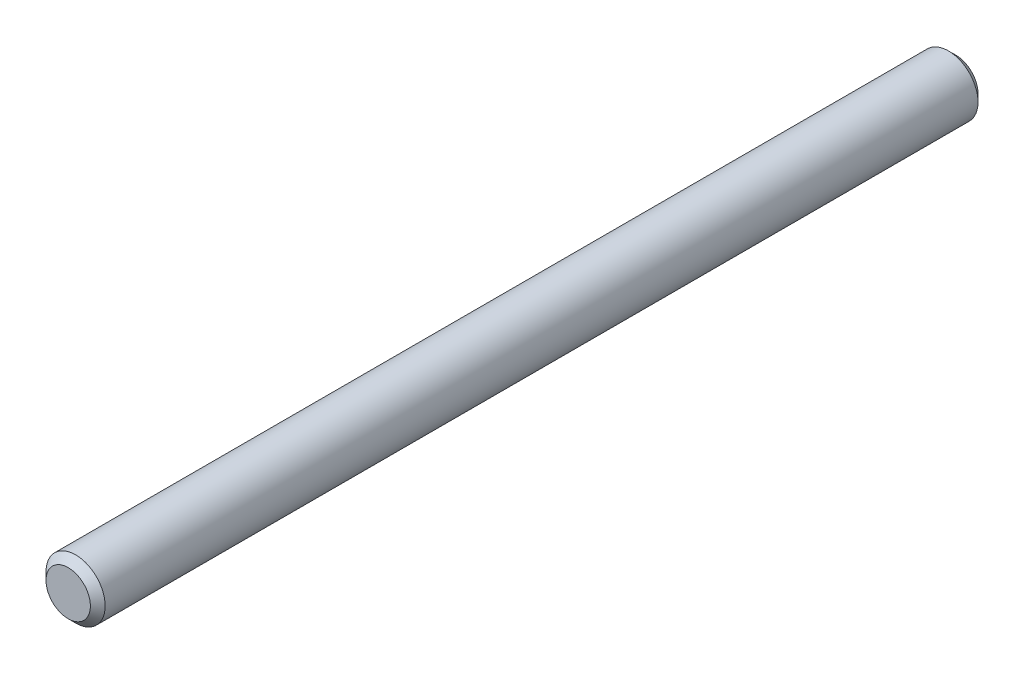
ISO-10303-21;
HEADER;
FILE_DESCRIPTION(('STEP AP214'),'2;1');
FILE_NAME('part.step','',(''),(''),'','','');
FILE_SCHEMA(('AUTOMOTIVE_DESIGN { 1 0 10303 214 1 1 1 1 }'));
ENDSEC;
DATA;
#1=APPLICATION_CONTEXT('core data for automotive mechanical design processes');
#2=APPLICATION_PROTOCOL_DEFINITION('international standard','automotive_design',2000,#1);
#3=PRODUCT_CONTEXT('',#1,'mechanical');
#4=PRODUCT('Part','Part','',(#3));
#5=PRODUCT_RELATED_PRODUCT_CATEGORY('part','',(#4));
#6=PRODUCT_DEFINITION_FORMATION('','',#4);
#7=PRODUCT_DEFINITION_CONTEXT('part definition',#1,'design');
#8=PRODUCT_DEFINITION('design','',#6,#7);
#9=PRODUCT_DEFINITION_SHAPE('','',#8);
#10=(LENGTH_UNIT() NAMED_UNIT(*) SI_UNIT(.MILLI.,.METRE.));
#11=(NAMED_UNIT(*) PLANE_ANGLE_UNIT() SI_UNIT($,.RADIAN.));
#12=(NAMED_UNIT(*) SI_UNIT($,.STERADIAN.) SOLID_ANGLE_UNIT());
#13=UNCERTAINTY_MEASURE_WITH_UNIT(LENGTH_MEASURE(1.E-05),#10,'distance_accuracy_value','');
#14=(GEOMETRIC_REPRESENTATION_CONTEXT(3) GLOBAL_UNCERTAINTY_ASSIGNED_CONTEXT((#13)) GLOBAL_UNIT_ASSIGNED_CONTEXT((#10,
#11,#12)) REPRESENTATION_CONTEXT('',''));
#15=CARTESIAN_POINT('',(0.,0.,0.));
#16=DIRECTION('',(0.,0.,1.));
#17=DIRECTION('',(1.,0.,0.));
#18=AXIS2_PLACEMENT_3D('',#15,#16,#17);
#19=CARTESIAN_POINT('',(0.,0.,-60.));
#20=DIRECTION('',(0.,0.,1.));
#21=DIRECTION('',(1.,0.,0.));
#22=AXIS2_PLACEMENT_3D('',#19,#20,#21);
#23=CYLINDRICAL_SURFACE('',#22,2.);
#24=CARTESIAN_POINT('',(0.,0.,-59.5));
#25=DIRECTION('',(0.,0.,1.));
#26=DIRECTION('',(1.,0.,0.));
#27=AXIS2_PLACEMENT_3D('',#24,#25,#26);
#28=CIRCLE('',#27,2.);
#29=CARTESIAN_POINT('',(2.,0.,-59.5));
#30=VERTEX_POINT('',#29);
#31=EDGE_CURVE('E43',#30,#30,#28,.T.);
#32=ORIENTED_EDGE('',*,*,#31,.T.);
#33=EDGE_LOOP('',(#32));
#34=FACE_BOUND('',#33,.T.);
#35=CARTESIAN_POINT('',(0.,0.,-0.499999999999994));
#36=DIRECTION('',(0.,0.,1.));
#37=DIRECTION('',(1.,0.,0.));
#38=AXIS2_PLACEMENT_3D('',#35,#36,#37);
#39=CIRCLE('',#38,2.);
#40=CARTESIAN_POINT('',(2.,0.,-0.499999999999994));
#41=VERTEX_POINT('',#40);
#42=EDGE_CURVE('E47',#41,#41,#39,.F.);
#43=ORIENTED_EDGE('',*,*,#42,.T.);
#44=EDGE_LOOP('',(#43));
#45=FACE_BOUND('',#44,.T.);
#46=ADVANCED_FACE('F32',(#34,#45),#23,.T.);
#47=CARTESIAN_POINT('',(0.,0.,-60.));
#48=DIRECTION('',(0.,0.,1.));
#49=DIRECTION('',(1.,0.,0.));
#50=AXIS2_PLACEMENT_3D('',#47,#48,#49);
#51=PLANE('',#50);
#52=CARTESIAN_POINT('',(0.,0.,-60.));
#53=DIRECTION('',(0.,0.,1.));
#54=DIRECTION('',(1.,0.,0.));
#55=AXIS2_PLACEMENT_3D('',#52,#53,#54);
#56=CIRCLE('',#55,1.50000000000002);
#57=CARTESIAN_POINT('',(1.50000000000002,0.,-60.));
#58=VERTEX_POINT('',#57);
#59=EDGE_CURVE('E39',#58,#58,#56,.F.);
#60=ORIENTED_EDGE('',*,*,#59,.T.);
#61=EDGE_LOOP('',(#60));
#62=FACE_BOUND('',#61,.T.);
#63=ADVANCED_FACE('F63',(#62),#51,.F.);
#64=CARTESIAN_POINT('',(0.,0.,0.));
#65=DIRECTION('',(0.,0.,1.));
#66=DIRECTION('',(1.,0.,0.));
#67=AXIS2_PLACEMENT_3D('',#64,#65,#66);
#68=PLANE('',#67);
#69=CARTESIAN_POINT('',(0.,0.,0.));
#70=DIRECTION('',(0.,0.,1.));
#71=DIRECTION('',(1.,0.,0.));
#72=AXIS2_PLACEMENT_3D('',#69,#70,#71);
#73=CIRCLE('',#72,1.50000000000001);
#74=CARTESIAN_POINT('',(1.50000000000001,0.,0.));
#75=VERTEX_POINT('',#74);
#76=EDGE_CURVE('E10',#75,#75,#73,.T.);
#77=ORIENTED_EDGE('',*,*,#76,.T.);
#78=EDGE_LOOP('',(#77));
#79=FACE_BOUND('',#78,.T.);
#80=ADVANCED_FACE('F60',(#79),#68,.T.);
#81=CARTESIAN_POINT('',(0.,0.,-59.5));
#82=DIRECTION('',(0.,0.,1.));
#83=DIRECTION('',(1.,0.,0.));
#84=AXIS2_PLACEMENT_3D('',#81,#82,#83);
#85=CONICAL_SURFACE('',#84,2.,0.78539816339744);
#86=ORIENTED_EDGE('',*,*,#59,.F.);
#87=EDGE_LOOP('',(#86));
#88=FACE_BOUND('',#87,.T.);
#89=ORIENTED_EDGE('',*,*,#31,.F.);
#90=EDGE_LOOP('',(#89));
#91=FACE_BOUND('',#90,.T.);
#92=ADVANCED_FACE('F56',(#88,#91),#85,.T.);
#93=CARTESIAN_POINT('',(0.,0.,0.));
#94=DIRECTION('',(0.,0.,-1.));
#95=DIRECTION('',(-1.,0.,0.));
#96=AXIS2_PLACEMENT_3D('',#93,#94,#95);
#97=CONICAL_SURFACE('',#96,1.50000000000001,0.785398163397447);
#98=ORIENTED_EDGE('',*,*,#42,.F.);
#99=EDGE_LOOP('',(#98));
#100=FACE_BOUND('',#99,.T.);
#101=ORIENTED_EDGE('',*,*,#76,.F.);
#102=EDGE_LOOP('',(#101));
#103=FACE_BOUND('',#102,.T.);
#104=ADVANCED_FACE('F34',(#100,#103),#97,.T.);
#105=CLOSED_SHELL('',(#46,#63,#80,#92,#104));
#106=MANIFOLD_SOLID_BREP('B2',#105);
#107=ADVANCED_BREP_SHAPE_REPRESENTATION('',(#18,#106),#14);
#108=SHAPE_DEFINITION_REPRESENTATION(#9,#107);
ENDSEC;
END-ISO-10303-21;
